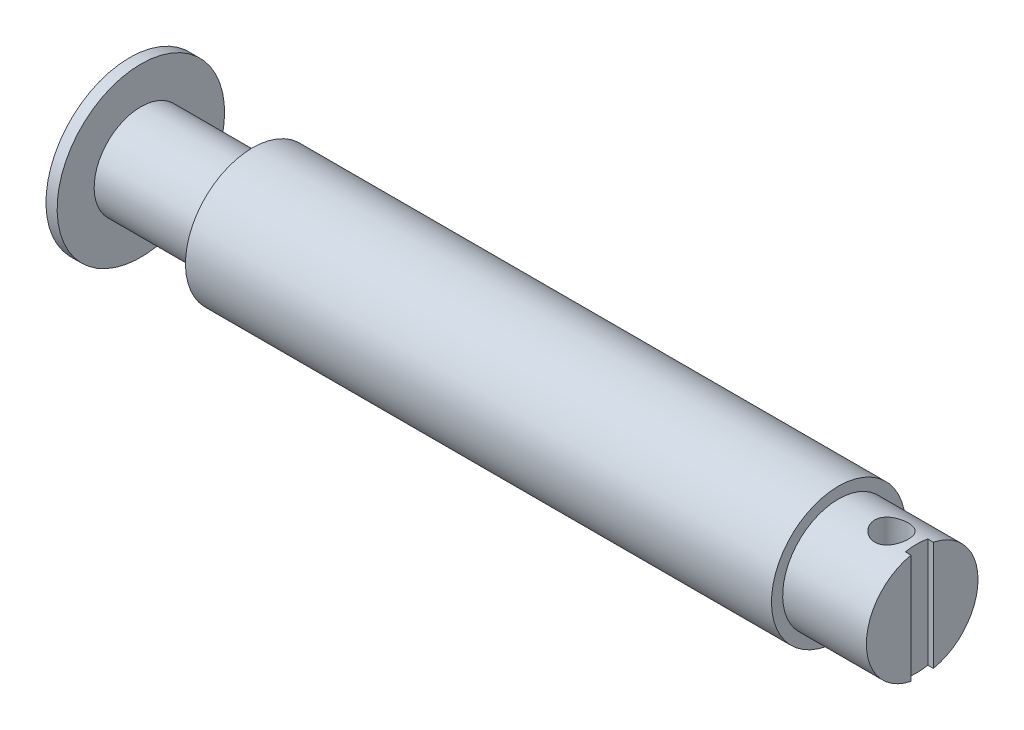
from build123d import *
from build123d.topology import SkipClean

# Parameters (mm, degrees)
ESQUISSE2_R             = 10
EXTRUSION1_DEPTH        = 15
ENL_V_START             = -1
ENL_V_MAT_EXTRU_1_DEPTH = 1
EXTRUSION2_DEPTH        = 1
ESQUISSE5_W             = 3
ESQUISSE5_H             = 20


with BuildPart() as part:
    # Esquisse1 → R_volution1 (revolve)
    with BuildSketch(Plane.XY):
        Polygon((-54, 15), (-54, 0), (73, 0), (73, 12), (-32, 12), (-32, 8.364637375), (-52, 8.364637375), (-52, 15), align=None)
    revolve(axis=Axis((-54, 0, 0), (1, 0, 0)))

    # Esquisse2 → Extrusion1 (add)
    with BuildSketch(Plane(origin=(73, 0, 0), x_dir=(0, 0, -1), z_dir=(1, 0, 0))):
        with Locations(Location((0, 0, 0), (0, 0, 90))):
            Circle(ESQUISSE2_R)
    extrude(amount=EXTRUSION1_DEPTH)

    # Esquisse3 → Enl_v. mat.-Extru.1 (cut)
    with BuildSketch(Plane(origin=(88, 0, 0), x_dir=(0, 0, -1), z_dir=(1, 0, 0)).offset(ENL_V_START)):
        with BuildLine():
            Line((2, -9.797958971), (2, 9.797958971))
            ThreePointArc((2, 9.797958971), (-10, 0), (2, -9.797958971))
        make_face()
    extrude(amount=ENL_V_MAT_EXTRU_1_DEPTH, mode=Mode.SUBTRACT)

    # Esquisse4 → Extrusion2 (add)
    with SkipClean():  # the faces are left unmerged after this step: merging them gives an invalid solid
        with BuildSketch(Plane(origin=(87, 0, 0), x_dir=(0, 0, -1), z_dir=(1, 0, 0))):
            with BuildLine():
                Line((-2, 9.797958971), (-2, -9.797958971))
                ThreePointArc((-2, -9.797958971), (-10, 0), (-2, 9.797958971))
            make_face()
        extrude(amount=EXTRUSION2_DEPTH)

    # Esquisse5 → Enl_vement de mati_re-R_volution1 (revolve, cut)
    with BuildSketch(Plane.XY, mode=Mode.PRIVATE) as enl_vement_de_mati_re_r_volution1_sk:
        with Locations((81, 0)):
            Rectangle(ESQUISSE5_W, ESQUISSE5_H)
    revolve(enl_vement_de_mati_re_r_volution1_sk.sketch.rotate(Axis((82.5, -10, 0), (0, 1, 0)), 90), axis=Axis((82.5, -10, 0), (0, 1, 0)), mode=Mode.SUBTRACT)


solid = part.part
